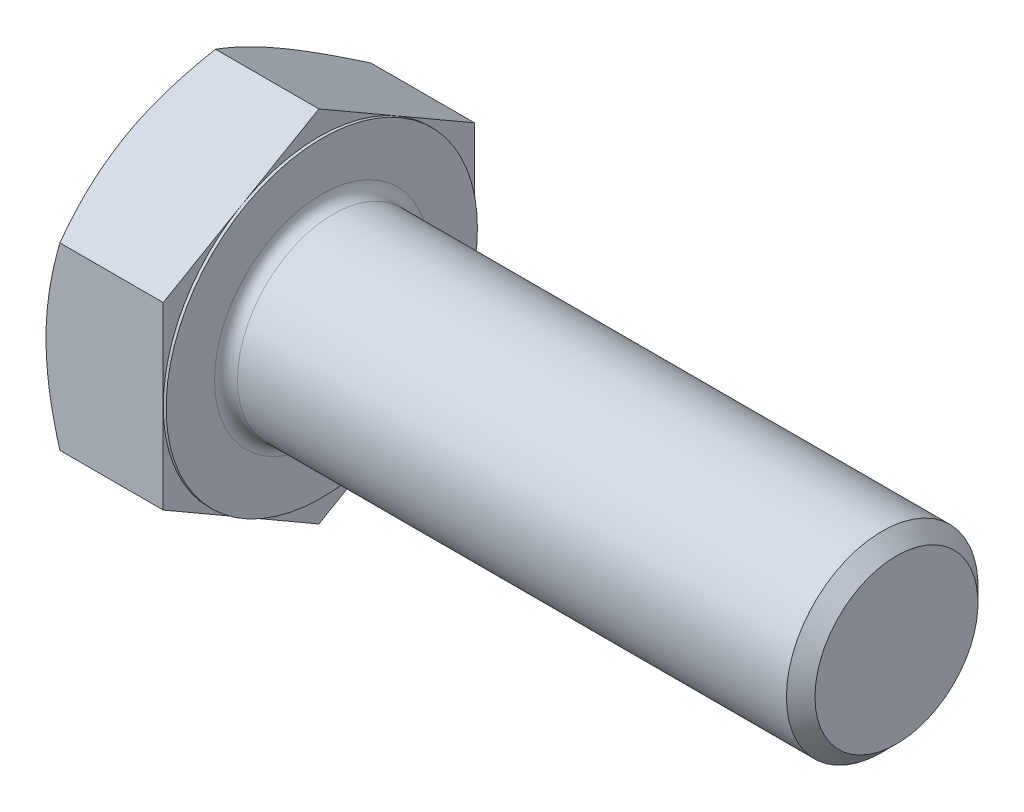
ISO-10303-21;
HEADER;
FILE_DESCRIPTION(('STEP AP214'),'2;1');
FILE_NAME('part.step','',(''),(''),'','','');
FILE_SCHEMA(('AUTOMOTIVE_DESIGN { 1 0 10303 214 1 1 1 1 }'));
ENDSEC;
DATA;
#1=APPLICATION_CONTEXT('core data for automotive mechanical design processes');
#2=APPLICATION_PROTOCOL_DEFINITION('international standard','automotive_design',2000,#1);
#3=PRODUCT_CONTEXT('',#1,'mechanical');
#4=PRODUCT('Part','Part','',(#3));
#5=PRODUCT_RELATED_PRODUCT_CATEGORY('part','',(#4));
#6=PRODUCT_DEFINITION_FORMATION('','',#4);
#7=PRODUCT_DEFINITION_CONTEXT('part definition',#1,'design');
#8=PRODUCT_DEFINITION('design','',#6,#7);
#9=PRODUCT_DEFINITION_SHAPE('','',#8);
#10=(LENGTH_UNIT() NAMED_UNIT(*) SI_UNIT(.MILLI.,.METRE.));
#11=(NAMED_UNIT(*) PLANE_ANGLE_UNIT() SI_UNIT($,.RADIAN.));
#12=(NAMED_UNIT(*) SI_UNIT($,.STERADIAN.) SOLID_ANGLE_UNIT());
#13=UNCERTAINTY_MEASURE_WITH_UNIT(LENGTH_MEASURE(1.E-05),#10,'distance_accuracy_value','');
#14=(GEOMETRIC_REPRESENTATION_CONTEXT(3) GLOBAL_UNCERTAINTY_ASSIGNED_CONTEXT((#13)) GLOBAL_UNIT_ASSIGNED_CONTEXT((#10,
#11,#12)) REPRESENTATION_CONTEXT('',''));
#15=CARTESIAN_POINT('',(0.,0.,0.));
#16=DIRECTION('',(0.,0.,1.));
#17=DIRECTION('',(1.,0.,0.));
#18=AXIS2_PLACEMENT_3D('',#15,#16,#17);
#19=CARTESIAN_POINT('',(15.9258,23.8301323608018,0.));
#20=DIRECTION('',(1.,0.,0.));
#21=DIRECTION('',(0.,0.,-1.));
#22=AXIS2_PLACEMENT_3D('',#19,#20,#21);
#23=PLANE('',#22);
#24=CARTESIAN_POINT('',(15.9258,0.,0.));
#25=DIRECTION('',(1.,0.,0.));
#26=DIRECTION('',(0.,0.,-1.));
#27=AXIS2_PLACEMENT_3D('',#24,#25,#26);
#28=CIRCLE('',#27,14.224);
#29=CARTESIAN_POINT('',(15.9258,0.,-14.224));
#30=VERTEX_POINT('',#29);
#31=EDGE_CURVE('E49',#30,#30,#28,.F.);
#32=ORIENTED_EDGE('',*,*,#31,.T.);
#33=EDGE_LOOP('',(#32));
#34=FACE_BOUND('',#33,.T.);
#35=CARTESIAN_POINT('',(15.9258,0.,0.));
#36=DIRECTION('',(1.,0.,0.));
#37=DIRECTION('',(0.,0.,-1.));
#38=AXIS2_PLACEMENT_3D('',#35,#36,#37);
#39=CIRCLE('',#38,20.6375);
#40=CARTESIAN_POINT('',(15.9258,0.,-20.6375));
#41=VERTEX_POINT('',#40);
#42=EDGE_CURVE('E332',#41,#41,#39,.T.);
#43=ORIENTED_EDGE('',*,*,#42,.T.);
#44=EDGE_LOOP('',(#43));
#45=FACE_BOUND('',#44,.T.);
#46=ADVANCED_FACE('F41',(#34,#45),#23,.T.);
#47=CARTESIAN_POINT('',(0.,0.,0.));
#48=DIRECTION('',(-1.,0.,0.));
#49=DIRECTION('',(0.,0.,1.));
#50=AXIS2_PLACEMENT_3D('',#47,#48,#49);
#51=CYLINDRICAL_SURFACE('',#50,12.7);
#52=CARTESIAN_POINT('',(17.4498,0.,0.));
#53=DIRECTION('',(1.,0.,0.));
#54=DIRECTION('',(0.,0.,-1.));
#55=AXIS2_PLACEMENT_3D('',#52,#53,#54);
#56=CIRCLE('',#55,12.7);
#57=CARTESIAN_POINT('',(17.4498,0.,-12.7));
#58=VERTEX_POINT('',#57);
#59=EDGE_CURVE('E11',#58,#58,#56,.T.);
#60=ORIENTED_EDGE('',*,*,#59,.T.);
#61=EDGE_LOOP('',(#60));
#62=FACE_BOUND('',#61,.T.);
#63=CARTESIAN_POINT('',(90.2335,0.,0.));
#64=DIRECTION('',(-1.,0.,0.));
#65=DIRECTION('',(0.,0.,1.));
#66=AXIS2_PLACEMENT_3D('',#63,#64,#65);
#67=CIRCLE('',#66,12.7);
#68=CARTESIAN_POINT('',(90.2335,0.,12.7));
#69=VERTEX_POINT('',#68);
#70=EDGE_CURVE('E297',#69,#69,#67,.T.);
#71=ORIENTED_EDGE('',*,*,#70,.T.);
#72=EDGE_LOOP('',(#71));
#73=FACE_BOUND('',#72,.T.);
#74=ADVANCED_FACE('F275',(#62,#73),#51,.T.);
#75=CARTESIAN_POINT('',(92.1258,0.,0.));
#76=DIRECTION('',(-1.,0.,0.));
#77=DIRECTION('',(0.,0.,1.));
#78=AXIS2_PLACEMENT_3D('',#75,#76,#77);
#79=CONICAL_SURFACE('',#78,10.8077,0.785398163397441);
#80=ORIENTED_EDGE('',*,*,#70,.F.);
#81=EDGE_LOOP('',(#80));
#82=FACE_BOUND('',#81,.T.);
#83=CARTESIAN_POINT('',(92.1258,0.,0.));
#84=DIRECTION('',(-1.,0.,0.));
#85=DIRECTION('',(0.,0.,1.));
#86=AXIS2_PLACEMENT_3D('',#83,#84,#85);
#87=CIRCLE('',#86,10.8077);
#88=CARTESIAN_POINT('',(92.1258,0.,10.8077));
#89=VERTEX_POINT('',#88);
#90=EDGE_CURVE('E300',#89,#89,#87,.T.);
#91=ORIENTED_EDGE('',*,*,#90,.T.);
#92=EDGE_LOOP('',(#91));
#93=FACE_BOUND('',#92,.T.);
#94=ADVANCED_FACE('F279',(#82,#93),#79,.T.);
#95=CARTESIAN_POINT('',(92.1258,0.,0.));
#96=DIRECTION('',(-1.,0.,0.));
#97=DIRECTION('',(0.,0.,1.));
#98=AXIS2_PLACEMENT_3D('',#95,#96,#97);
#99=PLANE('',#98);
#100=ORIENTED_EDGE('',*,*,#90,.F.);
#101=EDGE_LOOP('',(#100));
#102=FACE_BOUND('',#101,.T.);
#103=ADVANCED_FACE('F283',(#102),#99,.F.);
#104=CARTESIAN_POINT('',(15.5448,20.6375,0.));
#105=DIRECTION('',(1.,0.,0.));
#106=DIRECTION('',(0.,0.,-1.));
#107=AXIS2_PLACEMENT_3D('',#104,#105,#106);
#108=PLANE('',#107);
#109=DIRECTION('',(0.,0.500000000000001,0.866025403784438));
#110=VECTOR('',#109,1.);
#111=CARTESIAN_POINT('',(15.5448,11.9150661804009,-20.6375));
#112=LINE('',#111,#110);
#113=CARTESIAN_POINT('',(15.5448,11.9150661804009,-20.6375));
#114=VERTEX_POINT('',#113);
#115=CARTESIAN_POINT('',(15.5448,17.8725992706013,-10.31875));
#116=VERTEX_POINT('',#115);
#117=EDGE_CURVE('E185',#114,#116,#112,.T.);
#118=ORIENTED_EDGE('',*,*,#117,.T.);
#119=CARTESIAN_POINT('',(15.5448,0.,0.));
#120=DIRECTION('',(-1.,0.,0.));
#121=DIRECTION('',(0.,0.,1.));
#122=AXIS2_PLACEMENT_3D('',#119,#120,#121);
#123=CIRCLE('',#122,20.6375);
#124=CARTESIAN_POINT('',(15.5448,0.,-20.6375));
#125=VERTEX_POINT('',#124);
#126=EDGE_CURVE('E60',#116,#125,#123,.T.);
#127=ORIENTED_EDGE('',*,*,#126,.T.);
#128=DIRECTION('',(0.,1.,0.));
#129=VECTOR('',#128,1.);
#130=CARTESIAN_POINT('',(15.5448,11.9150661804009,-20.6375));
#131=LINE('',#130,#129);
#132=EDGE_CURVE('E337',#125,#114,#131,.T.);
#133=ORIENTED_EDGE('',*,*,#132,.T.);
#134=EDGE_LOOP('',(#118,#127,#133));
#135=FACE_BOUND('',#134,.T.);
#136=ADVANCED_FACE('F287',(#135),#108,.T.);
#137=CARTESIAN_POINT('',(15.5448,23.8301323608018,0.));
#138=VERTEX_POINT('',#137);
#139=EDGE_CURVE('E177',#116,#138,#112,.T.);
#140=ORIENTED_EDGE('',*,*,#139,.T.);
#141=DIRECTION('',(0.,-0.500000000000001,0.866025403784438));
#142=VECTOR('',#141,1.);
#143=CARTESIAN_POINT('',(15.5448,23.8301323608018,0.));
#144=LINE('',#143,#142);
#145=CARTESIAN_POINT('',(15.5448,17.8725992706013,10.31875));
#146=VERTEX_POINT('',#145);
#147=EDGE_CURVE('E178',#138,#146,#144,.T.);
#148=ORIENTED_EDGE('',*,*,#147,.T.);
#149=EDGE_CURVE('E162',#146,#116,#123,.T.);
#150=ORIENTED_EDGE('',*,*,#149,.T.);
#151=EDGE_LOOP('',(#140,#148,#150));
#152=FACE_BOUND('',#151,.T.);
#153=ADVANCED_FACE('F291',(#152),#108,.T.);
#154=CARTESIAN_POINT('',(15.5448,11.9150661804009,20.6375));
#155=VERTEX_POINT('',#154);
#156=EDGE_CURVE('E138',#146,#155,#144,.T.);
#157=ORIENTED_EDGE('',*,*,#156,.T.);
#158=DIRECTION('',(0.,-1.,0.));
#159=VECTOR('',#158,1.);
#160=CARTESIAN_POINT('',(15.5448,11.9150661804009,20.6375));
#161=LINE('',#160,#159);
#162=CARTESIAN_POINT('',(15.5448,0.,20.6375));
#163=VERTEX_POINT('',#162);
#164=EDGE_CURVE('E134',#155,#163,#161,.T.);
#165=ORIENTED_EDGE('',*,*,#164,.T.);
#166=EDGE_CURVE('E137',#163,#146,#123,.T.);
#167=ORIENTED_EDGE('',*,*,#166,.T.);
#168=EDGE_LOOP('',(#157,#165,#167));
#169=FACE_BOUND('',#168,.T.);
#170=ADVANCED_FACE('F135',(#169),#108,.T.);
#171=CARTESIAN_POINT('',(15.5448,-11.9150661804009,20.6375));
#172=VERTEX_POINT('',#171);
#173=EDGE_CURVE('E144',#163,#172,#161,.T.);
#174=ORIENTED_EDGE('',*,*,#173,.T.);
#175=DIRECTION('',(0.,-0.500000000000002,-0.866025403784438));
#176=VECTOR('',#175,1.);
#177=CARTESIAN_POINT('',(15.5448,-23.8301323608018,0.));
#178=LINE('',#177,#176);
#179=CARTESIAN_POINT('',(15.5448,-17.8725992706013,10.31875));
#180=VERTEX_POINT('',#179);
#181=EDGE_CURVE('E151',#172,#180,#178,.T.);
#182=ORIENTED_EDGE('',*,*,#181,.T.);
#183=EDGE_CURVE('E150',#180,#163,#123,.T.);
#184=ORIENTED_EDGE('',*,*,#183,.T.);
#185=EDGE_LOOP('',(#174,#182,#184));
#186=FACE_BOUND('',#185,.T.);
#187=ADVANCED_FACE('F146',(#186),#108,.T.);
#188=CARTESIAN_POINT('',(15.5448,-23.8301323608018,0.));
#189=VERTEX_POINT('',#188);
#190=EDGE_CURVE('E175',#180,#189,#178,.T.);
#191=ORIENTED_EDGE('',*,*,#190,.T.);
#192=DIRECTION('',(0.,0.5,-0.866025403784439));
#193=VECTOR('',#192,1.);
#194=CARTESIAN_POINT('',(15.5448,-11.9150661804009,-20.6375));
#195=LINE('',#194,#193);
#196=CARTESIAN_POINT('',(15.5448,-17.8725992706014,-10.31875));
#197=VERTEX_POINT('',#196);
#198=EDGE_CURVE('E374',#189,#197,#195,.T.);
#199=ORIENTED_EDGE('',*,*,#198,.T.);
#200=EDGE_CURVE('E156',#197,#180,#123,.T.);
#201=ORIENTED_EDGE('',*,*,#200,.T.);
#202=EDGE_LOOP('',(#191,#199,#201));
#203=FACE_BOUND('',#202,.T.);
#204=ADVANCED_FACE('F383',(#203),#108,.T.);
#205=CARTESIAN_POINT('',(15.5448,-11.9150661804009,-20.6375));
#206=VERTEX_POINT('',#205);
#207=EDGE_CURVE('E165',#197,#206,#195,.T.);
#208=ORIENTED_EDGE('',*,*,#207,.T.);
#209=EDGE_CURVE('E336',#206,#125,#131,.T.);
#210=ORIENTED_EDGE('',*,*,#209,.T.);
#211=EDGE_CURVE('E351',#125,#197,#123,.T.);
#212=ORIENTED_EDGE('',*,*,#211,.T.);
#213=EDGE_LOOP('',(#208,#210,#212));
#214=FACE_BOUND('',#213,.T.);
#215=ADVANCED_FACE('F295',(#214),#108,.T.);
#216=CARTESIAN_POINT('',(0.,0.,0.));
#217=DIRECTION('',(-1.,0.,0.));
#218=DIRECTION('',(0.,0.,1.));
#219=AXIS2_PLACEMENT_3D('',#216,#217,#218);
#220=CYLINDRICAL_SURFACE('',#219,20.6375);
#221=ORIENTED_EDGE('',*,*,#126,.F.);
#222=ORIENTED_EDGE('',*,*,#149,.F.);
#223=ORIENTED_EDGE('',*,*,#166,.F.);
#224=ORIENTED_EDGE('',*,*,#183,.F.);
#225=ORIENTED_EDGE('',*,*,#200,.F.);
#226=ORIENTED_EDGE('',*,*,#211,.F.);
#227=EDGE_LOOP('',(#221,#222,#223,#224,#225,#226));
#228=FACE_BOUND('',#227,.T.);
#229=ORIENTED_EDGE('',*,*,#42,.F.);
#230=EDGE_LOOP('',(#229));
#231=FACE_BOUND('',#230,.T.);
#232=ADVANCED_FACE('F158',(#228,#231),#220,.T.);
#233=CARTESIAN_POINT('',(0.,23.8301323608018,0.));
#234=DIRECTION('',(1.,0.,0.));
#235=DIRECTION('',(0.,0.,-1.));
#236=AXIS2_PLACEMENT_3D('',#233,#234,#235);
#237=PLANE('',#236);
#238=CARTESIAN_POINT('',(0.,0.,0.));
#239=DIRECTION('',(1.,0.,0.));
#240=DIRECTION('',(0.,0.,-1.));
#241=AXIS2_PLACEMENT_3D('',#238,#239,#240);
#242=CIRCLE('',#241,20.6375);
#243=CARTESIAN_POINT('',(0.,0.,-20.6375));
#244=VERTEX_POINT('',#243);
#245=CARTESIAN_POINT('',(0.,17.8725992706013,-10.31875));
#246=VERTEX_POINT('',#245);
#247=EDGE_CURVE('E331',#244,#246,#242,.T.);
#248=ORIENTED_EDGE('',*,*,#247,.F.);
#249=CARTESIAN_POINT('',(0.,-17.8725992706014,-10.31875));
#250=VERTEX_POINT('',#249);
#251=EDGE_CURVE('E326',#250,#244,#242,.T.);
#252=ORIENTED_EDGE('',*,*,#251,.F.);
#253=CARTESIAN_POINT('',(0.,-17.8725992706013,10.31875));
#254=VERTEX_POINT('',#253);
#255=EDGE_CURVE('E330',#254,#250,#242,.T.);
#256=ORIENTED_EDGE('',*,*,#255,.F.);
#257=CARTESIAN_POINT('',(0.,0.,20.6375));
#258=VERTEX_POINT('',#257);
#259=EDGE_CURVE('E398',#258,#254,#242,.T.);
#260=ORIENTED_EDGE('',*,*,#259,.F.);
#261=CARTESIAN_POINT('',(0.,0.,0.));
#262=DIRECTION('',(-1.,0.,0.));
#263=DIRECTION('',(0.,0.,1.));
#264=AXIS2_PLACEMENT_3D('',#261,#262,#263);
#265=CIRCLE('',#264,20.6375);
#266=CARTESIAN_POINT('',(0.,17.8725992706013,10.31875));
#267=VERTEX_POINT('',#266);
#268=EDGE_CURVE('E182',#258,#267,#265,.T.);
#269=ORIENTED_EDGE('',*,*,#268,.T.);
#270=EDGE_CURVE('E404',#246,#267,#242,.T.);
#271=ORIENTED_EDGE('',*,*,#270,.F.);
#272=EDGE_LOOP('',(#248,#252,#256,#260,#269,#271));
#273=FACE_BOUND('',#272,.T.);
#274=ADVANCED_FACE('F216',(#273),#237,.F.);
#275=CARTESIAN_POINT('',(0.,0.,0.));
#276=DIRECTION('',(1.,0.,0.));
#277=DIRECTION('',(0.,0.,-1.));
#278=AXIS2_PLACEMENT_3D('',#275,#276,#277);
#279=CONICAL_SURFACE('',#278,20.6375,1.0471975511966);
#280=CARTESIAN_POINT('',(1.84333382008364,11.914950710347,20.6377));
#281=CARTESIAN_POINT('',(1.69214337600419,12.1768388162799,20.1840964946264));
#282=CARTESIAN_POINT('',(1.54781374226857,12.4397484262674,19.7287236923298));
#283=CARTESIAN_POINT('',(1.27478315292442,12.9676758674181,18.814326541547));
#284=CARTESIAN_POINT('',(1.14608733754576,13.2326943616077,18.3553010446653));
#285=CARTESIAN_POINT('',(0.906054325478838,13.7653517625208,17.4327113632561));
#286=CARTESIAN_POINT('',(0.794758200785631,14.0329953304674,16.9691391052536));
#287=CARTESIAN_POINT('',(0.591914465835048,14.5701421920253,16.0387734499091));
#288=CARTESIAN_POINT('',(0.50036572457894,14.8396453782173,15.571980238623));
#289=CARTESIAN_POINT('',(0.340910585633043,15.3736059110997,14.6471334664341));
#290=CARTESIAN_POINT('',(0.272476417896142,15.6380236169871,14.1891485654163));
#291=CARTESIAN_POINT('',(0.157727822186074,16.1680706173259,13.27108023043));
#292=CARTESIAN_POINT('',(0.111413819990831,16.4336999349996,12.8109967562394));
#293=CARTESIAN_POINT('',(0.0420749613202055,16.9654047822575,11.890056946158));
#294=CARTESIAN_POINT('',(0.0190224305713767,17.2314794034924,11.4292021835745));
#295=CARTESIAN_POINT('',(-0.00329774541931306,17.7638741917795,10.5070673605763));
#296=CARTESIAN_POINT('',(-0.00256612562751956,18.03019435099,10.045787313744));
#297=CARTESIAN_POINT('',(0.0210208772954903,18.528085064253,9.18341530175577));
#298=CARTESIAN_POINT('',(0.0410000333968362,18.759691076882,8.78226192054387));
#299=CARTESIAN_POINT('',(0.0985671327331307,19.2223501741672,7.98091285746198));
#300=CARTESIAN_POINT('',(0.136154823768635,19.4534032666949,7.58071716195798));
#301=CARTESIAN_POINT('',(0.228287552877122,19.9148711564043,6.78143133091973));
#302=CARTESIAN_POINT('',(0.282847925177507,20.1452851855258,6.38234252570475));
#303=CARTESIAN_POINT('',(0.407960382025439,20.605009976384,5.58607583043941));
#304=CARTESIAN_POINT('',(0.478512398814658,20.8343207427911,5.18889793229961));
#305=CARTESIAN_POINT('',(0.71596653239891,21.530459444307,3.98315033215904));
#306=CARTESIAN_POINT('',(0.906558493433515,21.9953095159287,3.17800639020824));
#307=CARTESIAN_POINT('',(1.23103244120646,22.6874510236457,1.97918213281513));
#308=CARTESIAN_POINT('',(1.34550466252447,22.9171109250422,1.58139951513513));
#309=CARTESIAN_POINT('',(1.58603801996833,23.3748421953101,0.788585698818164));
#310=CARTESIAN_POINT('',(1.71209588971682,23.6029139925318,0.393553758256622));
#311=CARTESIAN_POINT('',(1.84333382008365,23.8302478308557,-0.000200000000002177));
#312=B_SPLINE_CURVE_WITH_KNOTS('',3,(#280,#281,#282,#283,#284,#285,#286,#287,#288,#289,#290,
#291,#292,#293,#294,#295,#296,#297,#298,#299,#300,#301,#302,#303,#304,#305,#306,#307,#308,#309,
#310,#311),.UNSPECIFIED.,.F.,.F.,(4,2,2,2,2,2,2,2,2,2,2,2,2,2,2,4),(0.,1.63552456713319,
3.27158542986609,4.91145173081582,6.55122408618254,8.1505234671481,9.74985363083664,
11.3472788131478,12.9446546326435,14.3352468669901,15.7258191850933,17.1176515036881,
18.5094779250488,21.3544387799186,22.7744411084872,24.1940443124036),.UNSPECIFIED.);
#313=CARTESIAN_POINT('',(1.84326715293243,23.8301323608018,0.));
#314=VERTEX_POINT('',#313);
#315=EDGE_CURVE('E240',#267,#314,#312,.T.);
#316=ORIENTED_EDGE('',*,*,#315,.T.);
#317=CARTESIAN_POINT('',(1.84333382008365,23.8302478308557,0.0002));
#318=CARTESIAN_POINT('',(1.69214337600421,23.5683597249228,-0.453403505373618));
#319=CARTESIAN_POINT('',(1.54781374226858,23.3054501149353,-0.908776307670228));
#320=CARTESIAN_POINT('',(1.27478315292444,22.7775226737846,-1.82317345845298));
#321=CARTESIAN_POINT('',(1.14608733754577,22.512504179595,-2.28219895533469));
#322=CARTESIAN_POINT('',(0.906054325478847,21.9798467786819,-3.20478863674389));
#323=CARTESIAN_POINT('',(0.79475820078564,21.7122032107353,-3.66836089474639));
#324=CARTESIAN_POINT('',(0.591914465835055,21.1750563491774,-4.59872655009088));
#325=CARTESIAN_POINT('',(0.500365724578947,20.9055531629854,-5.06551976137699));
#326=CARTESIAN_POINT('',(0.340910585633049,20.371592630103,-5.99036653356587));
#327=CARTESIAN_POINT('',(0.272476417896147,20.1071749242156,-6.44835143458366));
#328=CARTESIAN_POINT('',(0.157727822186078,19.5771279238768,-7.36641976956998));
#329=CARTESIAN_POINT('',(0.111413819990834,19.3114986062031,-7.82650324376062));
#330=CARTESIAN_POINT('',(0.0420749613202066,18.7797937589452,-8.74744305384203));
#331=CARTESIAN_POINT('',(0.019022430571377,18.5137191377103,-9.2082978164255));
#332=CARTESIAN_POINT('',(-0.00329774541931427,17.9813243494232,-10.1304326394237));
#333=CARTESIAN_POINT('',(-0.00256612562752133,17.7150041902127,-10.591712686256));
#334=CARTESIAN_POINT('',(0.0210208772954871,17.2171134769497,-11.4540846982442));
#335=CARTESIAN_POINT('',(0.0410000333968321,16.9855074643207,-11.8552380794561));
#336=CARTESIAN_POINT('',(0.0985671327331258,16.5228483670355,-12.656587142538));
#337=CARTESIAN_POINT('',(0.136154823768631,16.2917952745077,-13.056782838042));
#338=CARTESIAN_POINT('',(0.228287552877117,15.8303273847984,-13.8560686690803));
#339=CARTESIAN_POINT('',(0.282847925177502,15.5999133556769,-14.2551574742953));
#340=CARTESIAN_POINT('',(0.407960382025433,15.1401885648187,-15.0514241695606));
#341=CARTESIAN_POINT('',(0.478512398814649,14.9108777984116,-15.4486020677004));
#342=CARTESIAN_POINT('',(0.715966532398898,14.2147390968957,-16.654349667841));
#343=CARTESIAN_POINT('',(0.906558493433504,13.749889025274,-17.4594936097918));
#344=CARTESIAN_POINT('',(1.23103244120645,13.057747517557,-18.6583178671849));
#345=CARTESIAN_POINT('',(1.34550466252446,12.8280876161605,-19.0561004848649));
#346=CARTESIAN_POINT('',(1.58603801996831,12.3703563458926,-19.8489143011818));
#347=CARTESIAN_POINT('',(1.7120958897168,12.1422845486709,-20.2439462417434));
#348=CARTESIAN_POINT('',(1.84333382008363,11.914950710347,-20.6377));
#349=B_SPLINE_CURVE_WITH_KNOTS('',3,(#317,#318,#319,#320,#321,#322,#323,#324,#325,#326,#327,
#328,#329,#330,#331,#332,#333,#334,#335,#336,#337,#338,#339,#340,#341,#342,#343,#344,#345,#346,
#347,#348),.UNSPECIFIED.,.F.,.F.,(4,2,2,2,2,2,2,2,2,2,2,2,2,2,2,4),(0.,1.63552456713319,
3.27158542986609,4.91145173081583,6.55122408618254,8.1505234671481,9.74985363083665,
11.3472788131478,12.9446546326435,14.3352468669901,15.7258191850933,17.1176515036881,
18.5094779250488,21.3544387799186,22.7744411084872,24.1940443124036),.UNSPECIFIED.);
#350=EDGE_CURVE('E63',#314,#246,#349,.T.);
#351=ORIENTED_EDGE('',*,*,#350,.T.);
#352=ORIENTED_EDGE('',*,*,#270,.T.);
#353=EDGE_LOOP('',(#316,#351,#352));
#354=FACE_BOUND('',#353,.T.);
#355=ADVANCED_FACE('F444',(#354),#279,.T.);
#356=CARTESIAN_POINT('',(10.1233678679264,-32.1118563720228,20.6375));
#357=CARTESIAN_POINT('',(9.90427008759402,-31.6607456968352,20.6375));
#358=CARTESIAN_POINT('',(9.68625680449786,-31.2091085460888,20.6375));
#359=CARTESIAN_POINT('',(9.25264463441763,-30.3046714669,20.6375));
#360=CARTESIAN_POINT('',(9.03704577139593,-29.851871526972,20.6375));
#361=CARTESIAN_POINT('',(8.39418278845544,-28.4914436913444,20.6375));
#362=CARTESIAN_POINT('',(7.97091645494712,-27.5819195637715,20.6375));
#363=CARTESIAN_POINT('',(7.13532758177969,-25.7519215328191,20.6375));
#364=CARTESIAN_POINT('',(6.72307624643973,-24.8314150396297,20.6375));
#365=CARTESIAN_POINT('',(5.91529515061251,-22.9831190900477,20.6375));
#366=CARTESIAN_POINT('',(5.51976460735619,-22.0553299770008,20.6375));
#367=CARTESIAN_POINT('',(4.73729219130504,-20.1605940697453,20.6375));
#368=CARTESIAN_POINT('',(4.35105046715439,-19.1933566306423,20.6375));
#369=CARTESIAN_POINT('',(3.60754060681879,-17.2475981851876,20.6375));
#370=CARTESIAN_POINT('',(3.25027570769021,-16.2690759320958,20.6375));
#371=CARTESIAN_POINT('',(2.57402614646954,-14.3010202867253,20.6375));
#372=CARTESIAN_POINT('',(2.25496489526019,-13.3115134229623,20.6375));
#373=CARTESIAN_POINT('',(1.66527212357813,-11.3182120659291,20.6375));
#374=CARTESIAN_POINT('',(1.39462546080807,-10.3144221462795,20.6375));
#375=CARTESIAN_POINT('',(1.03545163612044,-8.80063418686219,20.6375));
#376=CARTESIAN_POINT('',(0.923771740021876,-8.29609693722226,20.6375));
#377=CARTESIAN_POINT('',(0.71732925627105,-7.28355521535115,20.6375));
#378=CARTESIAN_POINT('',(0.622566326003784,-6.7755508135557,20.6375));
#379=CARTESIAN_POINT('',(0.451625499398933,-5.75642686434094,20.6375));
#380=CARTESIAN_POINT('',(0.375446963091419,-5.24530742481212,20.6375));
#381=CARTESIAN_POINT('',(0.243185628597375,-4.22045710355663,20.6375));
#382=CARTESIAN_POINT('',(0.187102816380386,-3.70672622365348,20.6375));
#383=CARTESIAN_POINT('',(0.0968611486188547,-2.68415366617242,20.6375));
#384=CARTESIAN_POINT('',(0.0624231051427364,-2.17533677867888,20.6375));
#385=CARTESIAN_POINT('',(0.0151010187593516,-1.15670325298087,20.6375));
#386=CARTESIAN_POINT('',(0.0022166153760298,-0.646886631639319,20.6375));
#387=CARTESIAN_POINT('',(-0.00169134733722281,0.372835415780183,20.6375));
#388=CARTESIAN_POINT('',(0.00728516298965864,0.882740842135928,20.6375));
#389=CARTESIAN_POINT('',(0.0468787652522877,1.9017164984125,20.6375));
#390=CARTESIAN_POINT('',(0.0774968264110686,2.41078668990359,20.6375));
#391=CARTESIAN_POINT('',(0.17617491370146,3.63103902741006,20.6375));
#392=CARTESIAN_POINT('',(0.254325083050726,4.34141978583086,20.6375));
#393=CARTESIAN_POINT('',(0.448536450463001,5.75698322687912,20.6375));
#394=CARTESIAN_POINT('',(0.564602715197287,6.46216520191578,20.6375));
#395=CARTESIAN_POINT('',(0.83051756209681,7.86663403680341,20.6375));
#396=CARTESIAN_POINT('',(0.980392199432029,8.56591591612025,20.6375));
#397=CARTESIAN_POINT('',(1.30934404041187,9.95750121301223,20.6375));
#398=CARTESIAN_POINT('',(1.48842082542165,10.6498047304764,20.6375));
#399=CARTESIAN_POINT('',(1.8756560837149,12.0426964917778,20.6375));
#400=CARTESIAN_POINT('',(2.08437031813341,12.7431291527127,20.6375));
#401=CARTESIAN_POINT('',(2.52357115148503,14.1370960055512,20.6375));
#402=CARTESIAN_POINT('',(2.75405789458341,14.8306301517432,20.6375));
#403=CARTESIAN_POINT('',(3.23312600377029,16.2111388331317,20.6375));
#404=CARTESIAN_POINT('',(3.48170148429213,16.8981154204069,20.6375));
#405=CARTESIAN_POINT('',(3.99400235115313,18.2663626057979,20.6375));
#406=CARTESIAN_POINT('',(4.25772755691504,18.9476332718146,20.6375));
#407=CARTESIAN_POINT('',(4.8988376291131,20.5590145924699,20.6375));
#408=CARTESIAN_POINT('',(5.28183896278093,21.4868873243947,20.6375));
#409=CARTESIAN_POINT('',(6.06661514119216,23.3346835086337,20.6375));
#410=CARTESIAN_POINT('',(6.46839117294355,24.2546064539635,20.6375));
#411=CARTESIAN_POINT('',(7.28694571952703,26.0879885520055,20.6375));
#412=CARTESIAN_POINT('',(7.70372765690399,27.001446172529,20.6375));
#413=CARTESIAN_POINT('',(8.54925608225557,28.8227686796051,20.6375));
#414=CARTESIAN_POINT('',(8.97800230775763,29.7306336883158,20.6375));
#415=CARTESIAN_POINT('',(9.84569867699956,31.5427118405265,20.6375));
#416=CARTESIAN_POINT('',(10.2846596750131,32.4469197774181,20.6375));
#417=CARTESIAN_POINT('',(11.1705735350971,34.2514113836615,20.6375));
#418=CARTESIAN_POINT('',(11.6175264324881,35.1516950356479,20.6375));
#419=CARTESIAN_POINT('',(12.517991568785,36.9488265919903,20.6375));
#420=CARTESIAN_POINT('',(12.9715029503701,37.845674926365,20.6375));
#421=CARTESIAN_POINT('',(13.8840629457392,39.6365449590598,20.6375));
#422=CARTESIAN_POINT('',(14.3431115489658,40.5305666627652,20.6375));
#423=CARTESIAN_POINT('',(15.6493121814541,43.0582372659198,20.6375));
#424=CARTESIAN_POINT('',(16.5019361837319,44.6890583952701,20.6375));
#425=CARTESIAN_POINT('',(18.218831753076,47.944618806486,20.6375));
#426=CARTESIAN_POINT('',(19.0831037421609,49.5693578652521,20.6375));
#427=CARTESIAN_POINT('',(20.8183569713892,52.8099478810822,20.6375));
#428=CARTESIAN_POINT('',(21.6893156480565,54.4258109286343,20.6375));
#429=CARTESIAN_POINT('',(23.000931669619,56.8467384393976,20.6375));
#430=CARTESIAN_POINT('',(23.4389878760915,57.6532142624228,20.6375));
#431=CARTESIAN_POINT('',(24.3166534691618,59.2653187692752,20.6375));
#432=CARTESIAN_POINT('',(24.756262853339,60.0709474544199,20.6375));
#433=CARTESIAN_POINT('',(25.1965591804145,60.8762006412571,20.6375));
#434=B_SPLINE_CURVE_WITH_KNOTS('',3,(#356,#357,#358,#359,#360,#361,#362,#363,#364,#365,#366,
#367,#368,#369,#370,#371,#372,#373,#374,#375,#376,#377,#378,#379,#380,#381,#382,#383,#384,#385,
#386,#387,#388,#389,#390,#391,#392,#393,#394,#395,#396,#397,#398,#399,#400,#401,#402,#403,#404,
#405,#406,#407,#408,#409,#410,#411,#412,#413,#414,#415,#416,#417,#418,#419,#420,#421,#422,#423,
#424,#425,#426,#427,#428,#429,#430,#431,#432,#433),.UNSPECIFIED.,.F.,.F.,(4,2,2,2,2,2,2,2,2,2,2,
2,2,2,2,2,2,2,2,2,2,2,2,2,2,2,2,2,2,2,2,2,2,2,2,2,2,2,4),(0.,1.5045045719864,3.00902406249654,
6.01850276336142,9.04418712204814,12.0697296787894,15.1938876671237,18.3183941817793,
21.4365280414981,24.5536849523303,26.1036962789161,27.6536762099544,29.2036027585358,
30.7535282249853,32.2830277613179,33.8125017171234,35.341980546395,36.8715278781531,
39.0143441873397,41.1574469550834,43.302207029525,45.4469363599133,47.6391167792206,
49.8313117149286,52.0227965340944,54.2142552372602,57.2254091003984,60.2367535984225,
63.2487893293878,66.260759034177,69.2760903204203,72.2914349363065,75.3063888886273,
78.3213370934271,83.842036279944,89.362936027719,94.869839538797,97.6231396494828,
100.376435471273),.UNSPECIFIED.);
#435=CARTESIAN_POINT('',(1.84326715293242,11.9150661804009,20.6375));
#436=VERTEX_POINT('',#435);
#437=EDGE_CURVE('E255',#258,#436,#434,.T.);
#438=ORIENTED_EDGE('',*,*,#437,.T.);
#439=EDGE_CURVE('E252',#436,#267,#312,.T.);
#440=ORIENTED_EDGE('',*,*,#439,.T.);
#441=ORIENTED_EDGE('',*,*,#268,.F.);
#442=EDGE_LOOP('',(#438,#440,#441));
#443=FACE_BOUND('',#442,.T.);
#444=ADVANCED_FACE('F450',(#443),#279,.T.);
#445=CARTESIAN_POINT('',(1.84326715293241,-11.9150661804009,20.6375));
#446=VERTEX_POINT('',#445);
#447=EDGE_CURVE('E301',#446,#258,#434,.T.);
#448=ORIENTED_EDGE('',*,*,#447,.T.);
#449=ORIENTED_EDGE('',*,*,#259,.T.);
#450=CARTESIAN_POINT('',(1.84333382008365,-23.8302478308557,-0.000200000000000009));
#451=CARTESIAN_POINT('',(1.69214337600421,-23.5683597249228,0.453403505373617));
#452=CARTESIAN_POINT('',(1.54781374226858,-23.3054501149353,0.908776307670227));
#453=CARTESIAN_POINT('',(1.27478315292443,-22.7775226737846,1.82317345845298));
#454=CARTESIAN_POINT('',(1.14608733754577,-22.512504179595,2.28219895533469));
#455=CARTESIAN_POINT('',(0.906054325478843,-21.9798467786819,3.20478863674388));
#456=CARTESIAN_POINT('',(0.794758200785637,-21.7122032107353,3.66836089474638));
#457=CARTESIAN_POINT('',(0.591914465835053,-21.1750563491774,4.59872655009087));
#458=CARTESIAN_POINT('',(0.500365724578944,-20.9055531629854,5.06551976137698));
#459=CARTESIAN_POINT('',(0.340910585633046,-20.371592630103,5.99036653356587));
#460=CARTESIAN_POINT('',(0.272476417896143,-20.1071749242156,6.44835143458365));
#461=CARTESIAN_POINT('',(0.157727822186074,-19.5771279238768,7.36641976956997));
#462=CARTESIAN_POINT('',(0.11141381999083,-19.3114986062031,7.82650324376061));
#463=CARTESIAN_POINT('',(0.0420749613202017,-18.7797937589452,8.74744305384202));
#464=CARTESIAN_POINT('',(0.0190224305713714,-18.5137191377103,9.20829781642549));
#465=CARTESIAN_POINT('',(-0.00329774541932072,-17.9813243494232,10.1304326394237));
#466=CARTESIAN_POINT('',(-0.00256612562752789,-17.7150041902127,10.591712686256));
#467=CARTESIAN_POINT('',(0.0210208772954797,-17.2171134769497,11.4540846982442));
#468=CARTESIAN_POINT('',(0.0410000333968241,-16.9855074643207,11.8552380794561));
#469=CARTESIAN_POINT('',(0.0985671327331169,-16.5228483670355,12.656587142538));
#470=CARTESIAN_POINT('',(0.136154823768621,-16.2917952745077,13.056782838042));
#471=CARTESIAN_POINT('',(0.228287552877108,-15.8303273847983,13.8560686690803));
#472=CARTESIAN_POINT('',(0.282847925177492,-15.5999133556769,14.2551574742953));
#473=CARTESIAN_POINT('',(0.407960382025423,-15.1401885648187,15.0514241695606));
#474=CARTESIAN_POINT('',(0.47851239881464,-14.9108777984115,15.4486020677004));
#475=CARTESIAN_POINT('',(0.715966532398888,-14.2147390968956,16.654349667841));
#476=CARTESIAN_POINT('',(0.906558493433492,-13.7498890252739,17.4594936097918));
#477=CARTESIAN_POINT('',(1.23103244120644,-13.057747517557,18.6583178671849));
#478=CARTESIAN_POINT('',(1.34550466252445,-12.8280876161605,19.0561004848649));
#479=CARTESIAN_POINT('',(1.58603801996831,-12.3703563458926,19.8489143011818));
#480=CARTESIAN_POINT('',(1.7120958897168,-12.1422845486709,20.2439462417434));
#481=CARTESIAN_POINT('',(1.84333382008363,-11.914950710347,20.6377));
#482=B_SPLINE_CURVE_WITH_KNOTS('',3,(#450,#451,#452,#453,#454,#455,#456,#457,#458,#459,#460,
#461,#462,#463,#464,#465,#466,#467,#468,#469,#470,#471,#472,#473,#474,#475,#476,#477,#478,#479,
#480,#481),.UNSPECIFIED.,.F.,.F.,(4,2,2,2,2,2,2,2,2,2,2,2,2,2,2,4),(0.,1.63552456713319,
3.27158542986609,4.91145173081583,6.55122408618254,8.1505234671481,9.74985363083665,
11.3472788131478,12.9446546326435,14.3352468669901,15.7258191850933,17.1176515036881,
18.5094779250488,21.3544387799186,22.7744411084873,24.1940443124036),.UNSPECIFIED.);
#483=EDGE_CURVE('E237',#254,#446,#482,.T.);
#484=ORIENTED_EDGE('',*,*,#483,.T.);
#485=EDGE_LOOP('',(#448,#449,#484));
#486=FACE_BOUND('',#485,.T.);
#487=ADVANCED_FACE('F205',(#486),#279,.T.);
#488=CARTESIAN_POINT('',(1.84326715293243,-23.8301323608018,0.));
#489=VERTEX_POINT('',#488);
#490=EDGE_CURVE('E229',#489,#254,#482,.T.);
#491=ORIENTED_EDGE('',*,*,#490,.T.);
#492=ORIENTED_EDGE('',*,*,#255,.T.);
#493=CARTESIAN_POINT('',(1.84333382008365,-11.9149507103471,-20.6377));
#494=CARTESIAN_POINT('',(1.69214337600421,-12.1768388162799,-20.1840964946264));
#495=CARTESIAN_POINT('',(1.54781374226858,-12.4397484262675,-19.7287236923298));
#496=CARTESIAN_POINT('',(1.27478315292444,-12.9676758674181,-18.814326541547));
#497=CARTESIAN_POINT('',(1.14608733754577,-13.2326943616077,-18.3553010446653));
#498=CARTESIAN_POINT('',(0.906054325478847,-13.7653517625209,-17.4327113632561));
#499=CARTESIAN_POINT('',(0.794758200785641,-14.0329953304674,-16.9691391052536));
#500=CARTESIAN_POINT('',(0.591914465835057,-14.5701421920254,-16.0387734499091));
#501=CARTESIAN_POINT('',(0.500365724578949,-14.8396453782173,-15.571980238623));
#502=CARTESIAN_POINT('',(0.340910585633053,-15.3736059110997,-14.6471334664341));
#503=CARTESIAN_POINT('',(0.272476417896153,-15.6380236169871,-14.1891485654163));
#504=CARTESIAN_POINT('',(0.157727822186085,-16.1680706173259,-13.27108023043));
#505=CARTESIAN_POINT('',(0.111413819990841,-16.4336999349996,-12.8109967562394));
#506=CARTESIAN_POINT('',(0.0420749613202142,-16.9654047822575,-11.890056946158));
#507=CARTESIAN_POINT('',(0.0190224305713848,-17.2314794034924,-11.4292021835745));
#508=CARTESIAN_POINT('',(-0.00329774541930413,-17.7638741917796,-10.5070673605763));
#509=CARTESIAN_POINT('',(-0.00256612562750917,-18.03019435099,-10.045787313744));
#510=CARTESIAN_POINT('',(0.0210208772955,-18.528085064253,-9.18341530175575));
#511=CARTESIAN_POINT('',(0.0410000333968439,-18.759691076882,-8.78226192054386));
#512=CARTESIAN_POINT('',(0.0985671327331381,-19.2223501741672,-7.98091285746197));
#513=CARTESIAN_POINT('',(0.136154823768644,-19.453403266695,-7.58071716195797));
#514=CARTESIAN_POINT('',(0.228287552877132,-19.9148711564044,-6.78143133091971));
#515=CARTESIAN_POINT('',(0.282847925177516,-20.1452851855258,-6.38234252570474));
#516=CARTESIAN_POINT('',(0.407960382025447,-20.605009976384,-5.5860758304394));
#517=CARTESIAN_POINT('',(0.478512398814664,-20.8343207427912,-5.1888979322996));
#518=CARTESIAN_POINT('',(0.715966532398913,-21.5304594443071,-3.98315033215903));
#519=CARTESIAN_POINT('',(0.906558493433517,-21.9953095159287,-3.17800639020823));
#520=CARTESIAN_POINT('',(1.23103244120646,-22.6874510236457,-1.97918213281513));
#521=CARTESIAN_POINT('',(1.34550466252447,-22.9171109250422,-1.58139951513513));
#522=CARTESIAN_POINT('',(1.58603801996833,-23.3748421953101,-0.788585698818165));
#523=CARTESIAN_POINT('',(1.71209588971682,-23.6029139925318,-0.393553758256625));
#524=CARTESIAN_POINT('',(1.84333382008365,-23.8302478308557,0.00019999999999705));
#525=B_SPLINE_CURVE_WITH_KNOTS('',3,(#493,#494,#495,#496,#497,#498,#499,#500,#501,#502,#503,
#504,#505,#506,#507,#508,#509,#510,#511,#512,#513,#514,#515,#516,#517,#518,#519,#520,#521,#522,
#523,#524),.UNSPECIFIED.,.F.,.F.,(4,2,2,2,2,2,2,2,2,2,2,2,2,2,2,4),(0.,1.63552456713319,
3.27158542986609,4.91145173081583,6.55122408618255,8.15052346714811,9.74985363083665,
11.3472788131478,12.9446546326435,14.3352468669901,15.7258191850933,17.1176515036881,
18.5094779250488,21.3544387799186,22.7744411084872,24.1940443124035),.UNSPECIFIED.);
#526=EDGE_CURVE('E238',#250,#489,#525,.T.);
#527=ORIENTED_EDGE('',*,*,#526,.T.);
#528=EDGE_LOOP('',(#491,#492,#527));
#529=FACE_BOUND('',#528,.T.);
#530=ADVANCED_FACE('F393',(#529),#279,.T.);
#531=CARTESIAN_POINT('',(1.84326715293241,11.9150661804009,-20.6375));
#532=VERTEX_POINT('',#531);
#533=EDGE_CURVE('E239',#246,#532,#349,.T.);
#534=ORIENTED_EDGE('',*,*,#533,.T.);
#535=CARTESIAN_POINT('',(10.1233678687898,-32.1118563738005,-20.6375));
#536=CARTESIAN_POINT('',(9.90427008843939,-31.660745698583,-20.6375));
#537=CARTESIAN_POINT('',(9.68625680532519,-31.2091085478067,-20.6375));
#538=CARTESIAN_POINT('',(9.25264463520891,-30.3046714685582,-20.6375));
#539=CARTESIAN_POINT('',(9.03704577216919,-29.8518715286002,-20.6375));
#540=CARTESIAN_POINT('',(8.39418278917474,-28.4914436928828,-20.6375));
#541=CARTESIAN_POINT('',(7.97091645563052,-27.58191956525,-20.6375));
#542=CARTESIAN_POINT('',(7.13532758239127,-25.7519215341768,-20.6375));
#543=CARTESIAN_POINT('',(6.72307624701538,-24.8314150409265,-20.6375));
#544=CARTESIAN_POINT('',(5.91529515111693,-22.9831190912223,-20.6375));
#545=CARTESIAN_POINT('',(5.51976460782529,-22.0553299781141,-20.6375));
#546=CARTESIAN_POINT('',(4.73729219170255,-20.1605940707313,-20.6375));
#547=CARTESIAN_POINT('',(4.35105046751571,-19.1933566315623,-20.6375));
#548=CARTESIAN_POINT('',(3.60754060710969,-17.2475981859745,-20.6375));
#549=CARTESIAN_POINT('',(3.25027570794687,-16.2690759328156,-20.6375));
#550=CARTESIAN_POINT('',(2.57402614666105,-14.3010202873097,-20.6375));
#551=CARTESIAN_POINT('',(2.25496489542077,-13.3115134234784,-20.6375));
#552=CARTESIAN_POINT('',(1.66527212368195,-11.3182120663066,-20.6375));
#553=CARTESIAN_POINT('',(1.39462546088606,-10.3144221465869,-20.6375));
#554=CARTESIAN_POINT('',(1.03545163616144,-8.80063418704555,-20.6375));
#555=CARTESIAN_POINT('',(0.92377174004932,-8.29609693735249,-20.6375));
#556=CARTESIAN_POINT('',(0.717329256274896,-7.28355521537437,-20.6375));
#557=CARTESIAN_POINT('',(0.622566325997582,-6.77555081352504,-20.6375));
#558=CARTESIAN_POINT('',(0.451625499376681,-5.75642686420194,-20.6375));
#559=CARTESIAN_POINT('',(0.37544696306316,-5.24530742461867,-20.6375));
#560=CARTESIAN_POINT('',(0.24318562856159,-4.22045710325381,-20.6375));
#561=CARTESIAN_POINT('',(0.187102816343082,-3.70672622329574,-20.6375));
#562=CARTESIAN_POINT('',(0.0968611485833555,-2.684153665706,-20.6375));
#563=CARTESIAN_POINT('',(0.0624231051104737,-2.1753367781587,-20.6375));
#564=CARTESIAN_POINT('',(0.015101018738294,-1.15670325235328,-20.6375));
#565=CARTESIAN_POINT('',(0.00221661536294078,-0.646886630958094,-20.6375));
#566=CARTESIAN_POINT('',(-0.00169134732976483,0.372835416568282,-20.6375));
#567=CARTESIAN_POINT('',(0.00728516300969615,0.882740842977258,-20.6375));
#568=CARTESIAN_POINT('',(0.0468787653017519,1.90171649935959,-20.6375));
#569=CARTESIAN_POINT('',(0.0774968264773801,2.4107866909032,-20.6375));
#570=CARTESIAN_POINT('',(0.176174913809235,3.6310390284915,-20.6375));
#571=CARTESIAN_POINT('',(0.254325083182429,4.34141978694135,-20.6375));
#572=CARTESIAN_POINT('',(0.448536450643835,5.75698322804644,-20.6375));
#573=CARTESIAN_POINT('',(0.564602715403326,6.46216520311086,-20.6375));
#574=CARTESIAN_POINT('',(0.830517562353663,7.86663403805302,-20.6375));
#575=CARTESIAN_POINT('',(0.980392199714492,8.56591591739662,-20.6375));
#576=CARTESIAN_POINT('',(1.30934404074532,9.95750121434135,-20.6375));
#577=CARTESIAN_POINT('',(1.48842082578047,10.6498047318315,-20.6375));
#578=CARTESIAN_POINT('',(1.87565608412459,12.0426964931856,-20.6375));
#579=CARTESIAN_POINT('',(2.08437031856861,12.7431291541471,-20.6375));
#580=CARTESIAN_POINT('',(2.52357115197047,14.1370960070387,-20.6375));
#581=CARTESIAN_POINT('',(2.75405789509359,14.8306301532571,-20.6375));
#582=CARTESIAN_POINT('',(3.23312600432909,16.2111388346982,-20.6375));
#583=CARTESIAN_POINT('',(3.4817014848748,16.8981154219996,-20.6375));
#584=CARTESIAN_POINT('',(3.99400235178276,18.266362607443,-20.6375));
#585=CARTESIAN_POINT('',(4.25772755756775,18.9476332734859,-20.6375));
#586=CARTESIAN_POINT('',(4.89883762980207,20.5590145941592,-20.6375));
#587=CARTESIAN_POINT('',(5.28183896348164,21.4868873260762,-20.6375));
#588=CARTESIAN_POINT('',(6.06661514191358,23.3346835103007,-20.6375));
#589=CARTESIAN_POINT('',(6.46839117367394,24.2546064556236,-20.6375));
#590=CARTESIAN_POINT('',(7.28694572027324,26.0879885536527,-20.6375));
#591=CARTESIAN_POINT('',(7.70372765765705,27.00144617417,-20.6375));
#592=CARTESIAN_POINT('',(8.54925608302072,28.8227686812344,-20.6375));
#593=CARTESIAN_POINT('',(8.97800230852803,29.7306336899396,-20.6375));
#594=CARTESIAN_POINT('',(9.84569867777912,31.5427118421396,-20.6375));
#595=CARTESIAN_POINT('',(10.2846596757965,32.4469197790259,-20.6375));
#596=CARTESIAN_POINT('',(11.1705735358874,34.2514113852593,-20.6375));
#597=CARTESIAN_POINT('',(11.6175264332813,35.1516950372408,-20.6375));
#598=CARTESIAN_POINT('',(12.5179915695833,36.948826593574,-20.6375));
#599=CARTESIAN_POINT('',(12.9715029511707,37.8456749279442,-20.6375));
#600=CARTESIAN_POINT('',(13.8840629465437,39.6365449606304,-20.6375));
#601=CARTESIAN_POINT('',(14.3431115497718,40.5305666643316,-20.6375));
#602=CARTESIAN_POINT('',(15.649312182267,43.0582372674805,-20.6375));
#603=CARTESIAN_POINT('',(16.5019361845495,44.6890583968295,-20.6375));
#604=CARTESIAN_POINT('',(18.2188317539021,47.9446188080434,-20.6375));
#605=CARTESIAN_POINT('',(19.0831037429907,49.5693578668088,-20.6375));
#606=CARTESIAN_POINT('',(20.8183569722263,52.8099478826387,-20.6375));
#607=CARTESIAN_POINT('',(21.6893156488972,54.4258109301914,-20.6375));
#608=CARTESIAN_POINT('',(23.0009316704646,56.8467384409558,-20.6375));
#609=CARTESIAN_POINT('',(23.4389878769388,57.6532142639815,-20.6375));
#610=CARTESIAN_POINT('',(24.3166534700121,59.2653187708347,-20.6375));
#611=CARTESIAN_POINT('',(24.7562628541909,60.0709474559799,-20.6375));
#612=CARTESIAN_POINT('',(25.1965591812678,60.8762006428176,-20.6375));
#613=B_SPLINE_CURVE_WITH_KNOTS('',3,(#535,#536,#537,#538,#539,#540,#541,#542,#543,#544,#545,
#546,#547,#548,#549,#550,#551,#552,#553,#554,#555,#556,#557,#558,#559,#560,#561,#562,#563,#564,
#565,#566,#567,#568,#569,#570,#571,#572,#573,#574,#575,#576,#577,#578,#579,#580,#581,#582,#583,
#584,#585,#586,#587,#588,#589,#590,#591,#592,#593,#594,#595,#596,#597,#598,#599,#600,#601,#602,
#603,#604,#605,#606,#607,#608,#609,#610,#611,#612),.UNSPECIFIED.,.F.,.F.,(4,2,2,2,2,2,2,2,2,2,2,
2,2,2,2,2,2,2,2,2,2,2,2,2,2,2,2,2,2,2,2,2,2,2,2,2,2,2,4),(0.,1.50450457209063,3.00902406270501,
6.0185027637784,9.04418712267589,12.0697296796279,15.1938876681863,18.3183941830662,
21.4365280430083,24.5536849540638,26.1036962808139,27.6536762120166,29.2036027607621,
30.7535282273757,32.2830277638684,33.812501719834,35.3419805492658,36.8715278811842,
39.0143441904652,41.1574469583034,43.3022070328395,45.4469363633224,47.6391167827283,
49.8313117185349,52.022796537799,54.2142552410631,57.2254091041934,60.2367536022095,
63.2487893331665,66.2607590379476,69.2760903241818,72.291434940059,75.3063888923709,
78.3213370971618,83.8420362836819,89.3629360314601,94.8698395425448,97.6231396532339,
100.376435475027),.UNSPECIFIED.);
#614=EDGE_CURVE('E197',#532,#244,#613,.F.);
#615=ORIENTED_EDGE('',*,*,#614,.T.);
#616=ORIENTED_EDGE('',*,*,#247,.T.);
#617=EDGE_LOOP('',(#534,#615,#616));
#618=FACE_BOUND('',#617,.T.);
#619=ADVANCED_FACE('F439',(#618),#279,.T.);
#620=CARTESIAN_POINT('',(1.84326715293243,-11.9150661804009,-20.6375));
#621=VERTEX_POINT('',#620);
#622=EDGE_CURVE('E199',#621,#250,#525,.T.);
#623=ORIENTED_EDGE('',*,*,#622,.T.);
#624=ORIENTED_EDGE('',*,*,#251,.T.);
#625=EDGE_CURVE('E190',#244,#621,#613,.F.);
#626=ORIENTED_EDGE('',*,*,#625,.T.);
#627=EDGE_LOOP('',(#623,#624,#626));
#628=FACE_BOUND('',#627,.T.);
#629=ADVANCED_FACE('F211',(#628),#279,.T.);
#630=CARTESIAN_POINT('',(15.9258,11.9150661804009,-20.6375));
#631=DIRECTION('',(0.,0.,1.));
#632=DIRECTION('',(0.,-1.,0.));
#633=AXIS2_PLACEMENT_3D('',#630,#631,#632);
#634=PLANE('',#633);
#635=ORIENTED_EDGE('',*,*,#209,.F.);
#636=DIRECTION('',(-1.,0.,0.));
#637=VECTOR('',#636,1.);
#638=CARTESIAN_POINT('',(15.9258,-11.9150661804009,-20.6375));
#639=LINE('',#638,#637);
#640=EDGE_CURVE('E315',#206,#621,#639,.T.);
#641=ORIENTED_EDGE('',*,*,#640,.T.);
#642=ORIENTED_EDGE('',*,*,#625,.F.);
#643=ORIENTED_EDGE('',*,*,#614,.F.);
#644=DIRECTION('',(-1.,0.,0.));
#645=VECTOR('',#644,1.);
#646=CARTESIAN_POINT('',(15.9258,11.9150661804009,-20.6375));
#647=LINE('',#646,#645);
#648=EDGE_CURVE('E306',#114,#532,#647,.T.);
#649=ORIENTED_EDGE('',*,*,#648,.F.);
#650=ORIENTED_EDGE('',*,*,#132,.F.);
#651=EDGE_LOOP('',(#635,#641,#642,#643,#649,#650));
#652=FACE_BOUND('',#651,.T.);
#653=ADVANCED_FACE('F209',(#652),#634,.F.);
#654=CARTESIAN_POINT('',(15.9258,-11.9150661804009,-20.6375));
#655=DIRECTION('',(0.,0.866025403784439,0.5));
#656=DIRECTION('',(0.,-0.5,0.866025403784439));
#657=AXIS2_PLACEMENT_3D('',#654,#655,#656);
#658=PLANE('',#657);
#659=ORIENTED_EDGE('',*,*,#198,.F.);
#660=DIRECTION('',(-1.,0.,0.));
#661=VECTOR('',#660,1.);
#662=CARTESIAN_POINT('',(15.9258,-23.8301323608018,0.));
#663=LINE('',#662,#661);
#664=EDGE_CURVE('E314',#189,#489,#663,.T.);
#665=ORIENTED_EDGE('',*,*,#664,.T.);
#666=ORIENTED_EDGE('',*,*,#526,.F.);
#667=ORIENTED_EDGE('',*,*,#622,.F.);
#668=ORIENTED_EDGE('',*,*,#640,.F.);
#669=ORIENTED_EDGE('',*,*,#207,.F.);
#670=EDGE_LOOP('',(#659,#665,#666,#667,#668,#669));
#671=FACE_BOUND('',#670,.T.);
#672=ADVANCED_FACE('F215',(#671),#658,.F.);
#673=CARTESIAN_POINT('',(15.9258,-23.8301323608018,0.));
#674=DIRECTION('',(0.,0.866025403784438,-0.500000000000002));
#675=DIRECTION('',(0.,0.500000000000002,0.866025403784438));
#676=AXIS2_PLACEMENT_3D('',#673,#674,#675);
#677=PLANE('',#676);
#678=ORIENTED_EDGE('',*,*,#181,.F.);
#679=DIRECTION('',(-1.,0.,0.));
#680=VECTOR('',#679,1.);
#681=CARTESIAN_POINT('',(15.9258,-11.9150661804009,20.6375));
#682=LINE('',#681,#680);
#683=EDGE_CURVE('E166',#172,#446,#682,.T.);
#684=ORIENTED_EDGE('',*,*,#683,.T.);
#685=ORIENTED_EDGE('',*,*,#483,.F.);
#686=ORIENTED_EDGE('',*,*,#490,.F.);
#687=ORIENTED_EDGE('',*,*,#664,.F.);
#688=ORIENTED_EDGE('',*,*,#190,.F.);
#689=EDGE_LOOP('',(#678,#684,#685,#686,#687,#688));
#690=FACE_BOUND('',#689,.T.);
#691=ADVANCED_FACE('F221',(#690),#677,.F.);
#692=CARTESIAN_POINT('',(15.9258,11.9150661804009,20.6375));
#693=DIRECTION('',(0.,0.,-1.));
#694=DIRECTION('',(-1.,0.,0.));
#695=AXIS2_PLACEMENT_3D('',#692,#693,#694);
#696=PLANE('',#695);
#697=ORIENTED_EDGE('',*,*,#164,.F.);
#698=DIRECTION('',(-1.,0.,0.));
#699=VECTOR('',#698,1.);
#700=CARTESIAN_POINT('',(15.9258,11.9150661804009,20.6375));
#701=LINE('',#700,#699);
#702=EDGE_CURVE('E318',#155,#436,#701,.T.);
#703=ORIENTED_EDGE('',*,*,#702,.T.);
#704=ORIENTED_EDGE('',*,*,#437,.F.);
#705=ORIENTED_EDGE('',*,*,#447,.F.);
#706=ORIENTED_EDGE('',*,*,#683,.F.);
#707=ORIENTED_EDGE('',*,*,#173,.F.);
#708=EDGE_LOOP('',(#697,#703,#704,#705,#706,#707));
#709=FACE_BOUND('',#708,.T.);
#710=ADVANCED_FACE('F168',(#709),#696,.F.);
#711=CARTESIAN_POINT('',(15.9258,23.8301323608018,0.));
#712=DIRECTION('',(0.,-0.866025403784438,-0.500000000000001));
#713=DIRECTION('',(0.,0.500000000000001,-0.866025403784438));
#714=AXIS2_PLACEMENT_3D('',#711,#712,#713);
#715=PLANE('',#714);
#716=ORIENTED_EDGE('',*,*,#147,.F.);
#717=DIRECTION('',(-1.,0.,0.));
#718=VECTOR('',#717,1.);
#719=CARTESIAN_POINT('',(15.9258,23.8301323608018,0.));
#720=LINE('',#719,#718);
#721=EDGE_CURVE('E325',#138,#314,#720,.T.);
#722=ORIENTED_EDGE('',*,*,#721,.T.);
#723=ORIENTED_EDGE('',*,*,#315,.F.);
#724=ORIENTED_EDGE('',*,*,#439,.F.);
#725=ORIENTED_EDGE('',*,*,#702,.F.);
#726=ORIENTED_EDGE('',*,*,#156,.F.);
#727=EDGE_LOOP('',(#716,#722,#723,#724,#725,#726));
#728=FACE_BOUND('',#727,.T.);
#729=ADVANCED_FACE('F260',(#728),#715,.F.);
#730=CARTESIAN_POINT('',(15.9258,11.9150661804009,-20.6375));
#731=DIRECTION('',(0.,-0.866025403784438,0.500000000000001));
#732=DIRECTION('',(0.,-0.500000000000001,-0.866025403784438));
#733=AXIS2_PLACEMENT_3D('',#730,#731,#732);
#734=PLANE('',#733);
#735=ORIENTED_EDGE('',*,*,#117,.F.);
#736=ORIENTED_EDGE('',*,*,#648,.T.);
#737=ORIENTED_EDGE('',*,*,#533,.F.);
#738=ORIENTED_EDGE('',*,*,#350,.F.);
#739=ORIENTED_EDGE('',*,*,#721,.F.);
#740=ORIENTED_EDGE('',*,*,#139,.F.);
#741=EDGE_LOOP('',(#735,#736,#737,#738,#739,#740));
#742=FACE_BOUND('',#741,.T.);
#743=ADVANCED_FACE('F261',(#742),#734,.F.);
#744=CARTESIAN_POINT('',(17.4498,0.,0.));
#745=DIRECTION('',(1.,0.,0.));
#746=DIRECTION('',(0.,0.,-1.));
#747=AXIS2_PLACEMENT_3D('',#744,#745,#746);
#748=TOROIDAL_SURFACE('',#747,14.224,1.524);
#749=ORIENTED_EDGE('',*,*,#59,.F.);
#750=EDGE_LOOP('',(#749));
#751=FACE_BOUND('',#750,.T.);
#752=ORIENTED_EDGE('',*,*,#31,.F.);
#753=EDGE_LOOP('',(#752));
#754=FACE_BOUND('',#753,.T.);
#755=ADVANCED_FACE('F43',(#751,#754),#748,.F.);
#756=CLOSED_SHELL('',(#46,#74,#94,#103,#136,#153,#170,#187,#204,#215,#232,#274,#355,#444,#487,
#530,#619,#629,#653,#672,#691,#710,#729,#743,#755));
#757=MANIFOLD_SOLID_BREP('B2',#756);
#758=ADVANCED_BREP_SHAPE_REPRESENTATION('',(#18,#757),#14);
#759=SHAPE_DEFINITION_REPRESENTATION(#9,#758);
ENDSEC;
END-ISO-10303-21;
